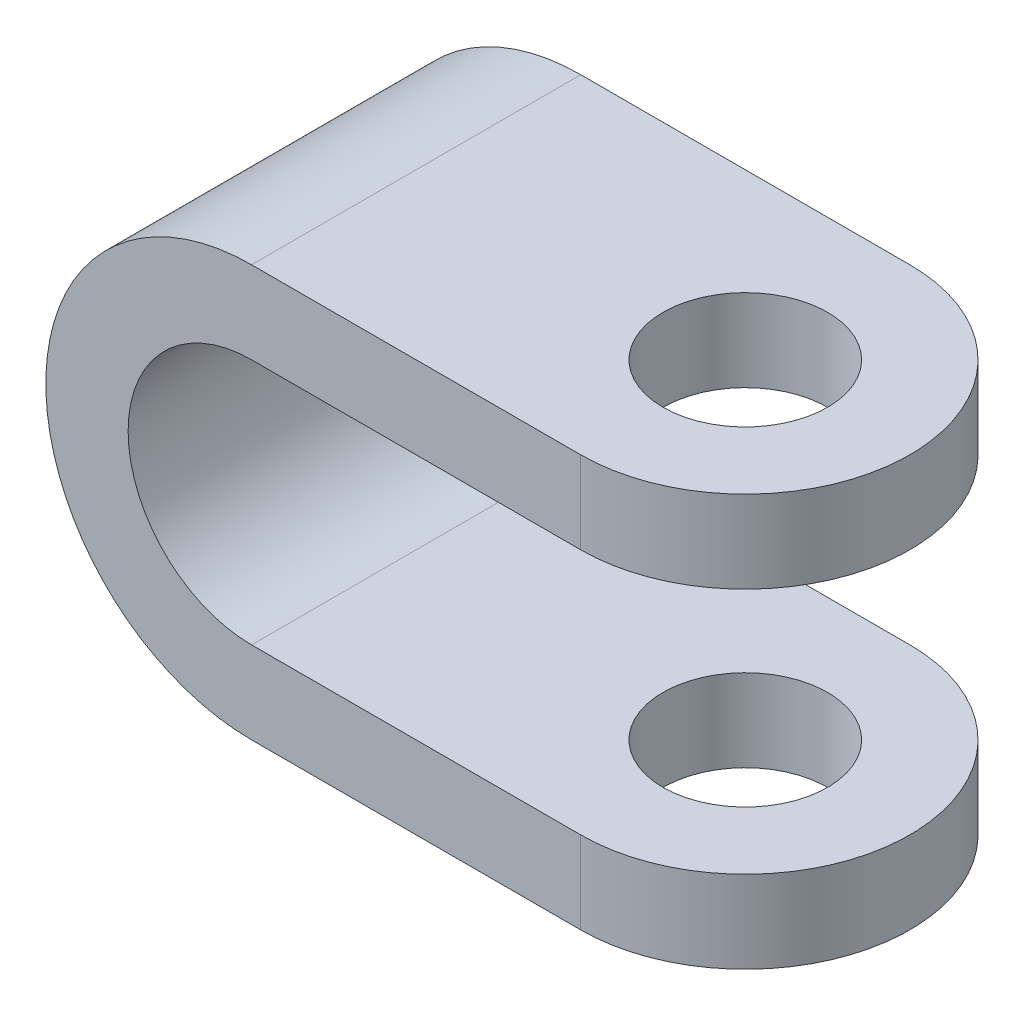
ISO-10303-21;
HEADER;
FILE_DESCRIPTION(('STEP AP214'),'2;1');
FILE_NAME('part.step','',(''),(''),'','','');
FILE_SCHEMA(('AUTOMOTIVE_DESIGN { 1 0 10303 214 1 1 1 1 }'));
ENDSEC;
DATA;
#1=APPLICATION_CONTEXT('core data for automotive mechanical design processes');
#2=APPLICATION_PROTOCOL_DEFINITION('international standard','automotive_design',2000,#1);
#3=PRODUCT_CONTEXT('',#1,'mechanical');
#4=PRODUCT('Part','Part','',(#3));
#5=PRODUCT_RELATED_PRODUCT_CATEGORY('part','',(#4));
#6=PRODUCT_DEFINITION_FORMATION('','',#4);
#7=PRODUCT_DEFINITION_CONTEXT('part definition',#1,'design');
#8=PRODUCT_DEFINITION('design','',#6,#7);
#9=PRODUCT_DEFINITION_SHAPE('','',#8);
#10=(LENGTH_UNIT() NAMED_UNIT(*) SI_UNIT(.MILLI.,.METRE.));
#11=(NAMED_UNIT(*) PLANE_ANGLE_UNIT() SI_UNIT($,.RADIAN.));
#12=(NAMED_UNIT(*) SI_UNIT($,.STERADIAN.) SOLID_ANGLE_UNIT());
#13=UNCERTAINTY_MEASURE_WITH_UNIT(LENGTH_MEASURE(1.E-05),#10,'distance_accuracy_value','');
#14=(GEOMETRIC_REPRESENTATION_CONTEXT(3) GLOBAL_UNCERTAINTY_ASSIGNED_CONTEXT((#13)) GLOBAL_UNIT_ASSIGNED_CONTEXT((#10,
#11,#12)) REPRESENTATION_CONTEXT('',''));
#15=CARTESIAN_POINT('',(0.,0.,0.));
#16=DIRECTION('',(0.,0.,1.));
#17=DIRECTION('',(1.,0.,0.));
#18=AXIS2_PLACEMENT_3D('',#15,#16,#17);
#19=CARTESIAN_POINT('',(-20.,-90.,45.));
#20=DIRECTION('',(0.,1.,0.));
#21=DIRECTION('',(0.,0.,1.));
#22=AXIS2_PLACEMENT_3D('',#19,#20,#21);
#23=CYLINDRICAL_SURFACE('',#22,10.);
#24=CARTESIAN_POINT('',(-20.,-25.,45.));
#25=DIRECTION('',(0.,-1.,0.));
#26=DIRECTION('',(1.,0.,0.));
#27=AXIS2_PLACEMENT_3D('',#24,#25,#26);
#28=CIRCLE('',#27,10.);
#29=CARTESIAN_POINT('',(-20.,-25.,55.));
#30=VERTEX_POINT('',#29);
#31=EDGE_CURVE('E169',#30,#30,#28,.F.);
#32=CARTESIAN_POINT('',(-20.,-15.,45.));
#33=DIRECTION('',(0.,-1.,0.));
#34=DIRECTION('',(1.,0.,0.));
#35=AXIS2_PLACEMENT_3D('',#32,#33,#34);
#36=CIRCLE('',#35,10.);
#37=CARTESIAN_POINT('',(-20.,-15.,55.));
#38=VERTEX_POINT('',#37);
#39=EDGE_CURVE('E112',#38,#38,#36,.F.);
#40=CARTESIAN_POINT('',(-20.,-25.,55.));
#41=CARTESIAN_POINT('',(-20.,-24.8958333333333,55.));
#42=CARTESIAN_POINT('',(-20.,-24.7916666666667,55.));
#43=CARTESIAN_POINT('',(-20.,-24.5833333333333,55.));
#44=CARTESIAN_POINT('',(-20.,-24.4791666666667,55.));
#45=CARTESIAN_POINT('',(-20.,-24.2708333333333,55.));
#46=CARTESIAN_POINT('',(-20.,-24.1666666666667,55.));
#47=CARTESIAN_POINT('',(-20.,-23.9583333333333,55.));
#48=CARTESIAN_POINT('',(-20.,-23.8541666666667,55.));
#49=CARTESIAN_POINT('',(-20.,-23.6458333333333,55.));
#50=CARTESIAN_POINT('',(-20.,-23.5416666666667,55.));
#51=CARTESIAN_POINT('',(-20.,-23.3333333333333,55.));
#52=CARTESIAN_POINT('',(-20.,-23.2291666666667,55.));
#53=CARTESIAN_POINT('',(-20.,-23.0208333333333,55.));
#54=CARTESIAN_POINT('',(-20.,-22.9166666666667,55.));
#55=CARTESIAN_POINT('',(-20.,-22.7083333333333,55.));
#56=CARTESIAN_POINT('',(-20.,-22.6041666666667,55.));
#57=CARTESIAN_POINT('',(-20.,-22.3958333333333,55.));
#58=CARTESIAN_POINT('',(-20.,-22.2916666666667,55.));
#59=CARTESIAN_POINT('',(-20.,-22.0833333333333,55.));
#60=CARTESIAN_POINT('',(-20.,-21.9791666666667,55.));
#61=CARTESIAN_POINT('',(-20.,-21.7708333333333,55.));
#62=CARTESIAN_POINT('',(-20.,-21.6666666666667,55.));
#63=CARTESIAN_POINT('',(-20.,-21.4583333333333,55.));
#64=CARTESIAN_POINT('',(-20.,-21.3541666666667,55.));
#65=CARTESIAN_POINT('',(-20.,-21.1458333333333,55.));
#66=CARTESIAN_POINT('',(-20.,-21.0416666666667,55.));
#67=CARTESIAN_POINT('',(-20.,-20.8333333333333,55.));
#68=CARTESIAN_POINT('',(-20.,-20.7291666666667,55.));
#69=CARTESIAN_POINT('',(-20.,-20.5208333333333,55.));
#70=CARTESIAN_POINT('',(-20.,-20.4166666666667,55.));
#71=CARTESIAN_POINT('',(-20.,-20.2083333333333,55.));
#72=CARTESIAN_POINT('',(-20.,-20.1041666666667,55.));
#73=CARTESIAN_POINT('',(-20.,-19.8958333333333,55.));
#74=CARTESIAN_POINT('',(-20.,-19.7916666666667,55.));
#75=CARTESIAN_POINT('',(-20.,-19.5833333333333,55.));
#76=CARTESIAN_POINT('',(-20.,-19.4791666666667,55.));
#77=CARTESIAN_POINT('',(-20.,-19.2708333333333,55.));
#78=CARTESIAN_POINT('',(-20.,-19.1666666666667,55.));
#79=CARTESIAN_POINT('',(-20.,-18.9583333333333,55.));
#80=CARTESIAN_POINT('',(-20.,-18.8541666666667,55.));
#81=CARTESIAN_POINT('',(-20.,-18.6458333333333,55.));
#82=CARTESIAN_POINT('',(-20.,-18.5416666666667,55.));
#83=CARTESIAN_POINT('',(-20.,-18.3333333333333,55.));
#84=CARTESIAN_POINT('',(-20.,-18.2291666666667,55.));
#85=CARTESIAN_POINT('',(-20.,-18.0208333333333,55.));
#86=CARTESIAN_POINT('',(-20.,-17.9166666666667,55.));
#87=CARTESIAN_POINT('',(-20.,-17.7083333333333,55.));
#88=CARTESIAN_POINT('',(-20.,-17.6041666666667,55.));
#89=CARTESIAN_POINT('',(-20.,-17.3958333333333,55.));
#90=CARTESIAN_POINT('',(-20.,-17.2916666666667,55.));
#91=CARTESIAN_POINT('',(-20.,-17.0833333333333,55.));
#92=CARTESIAN_POINT('',(-20.,-16.9791666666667,55.));
#93=CARTESIAN_POINT('',(-20.,-16.7708333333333,55.));
#94=CARTESIAN_POINT('',(-20.,-16.6666666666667,55.));
#95=CARTESIAN_POINT('',(-20.,-16.4583333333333,55.));
#96=CARTESIAN_POINT('',(-20.,-16.3541666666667,55.));
#97=CARTESIAN_POINT('',(-20.,-16.1458333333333,55.));
#98=CARTESIAN_POINT('',(-20.,-16.0416666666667,55.));
#99=CARTESIAN_POINT('',(-20.,-15.8333333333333,55.));
#100=CARTESIAN_POINT('',(-20.,-15.7291666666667,55.));
#101=CARTESIAN_POINT('',(-20.,-15.5208333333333,55.));
#102=CARTESIAN_POINT('',(-20.,-15.4166666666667,55.));
#103=CARTESIAN_POINT('',(-20.,-15.2083333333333,55.));
#104=CARTESIAN_POINT('',(-20.,-15.1041666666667,55.));
#105=CARTESIAN_POINT('',(-20.,-15.,55.));
#106=B_SPLINE_CURVE_WITH_KNOTS('',3,(#40,#41,#42,#43,#44,#45,#46,#47,#48,#49,#50,#51,#52,#53,
#54,#55,#56,#57,#58,#59,#60,#61,#62,#63,#64,#65,#66,#67,#68,#69,#70,#71,#72,#73,#74,#75,#76,#77,
#78,#79,#80,#81,#82,#83,#84,#85,#86,#87,#88,#89,#90,#91,#92,#93,#94,#95,#96,#97,#98,#99,#100,
#101,#102,#103,#104,#105),.UNSPECIFIED.,.F.,.F.,(4,2,2,2,2,2,2,2,2,2,2,2,2,2,2,2,2,2,2,2,2,2,2,
2,2,2,2,2,2,2,2,2,4),(0.,0.312499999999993,0.625000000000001,0.937500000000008,1.25,
1.56249999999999,1.875,2.18750000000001,2.5,2.8125,3.125,3.43750000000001,3.75,4.0625,4.375,
4.68750000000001,5.,5.3125,5.62500000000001,5.93750000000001,6.25000000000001,6.5625,
6.87500000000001,7.18750000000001,7.50000000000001,7.8125,8.12500000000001,8.43750000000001,
8.75000000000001,9.0625,9.37500000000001,9.68750000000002,10.),.UNSPECIFIED.);
#107=EDGE_CURVE('BSEAM34',#30,#38,#106,.T.);
#108=ORIENTED_EDGE('',*,*,#31,.F.);
#109=ORIENTED_EDGE('',*,*,#39,.T.);
#110=ORIENTED_EDGE('',*,*,#107,.T.);
#111=ORIENTED_EDGE('',*,*,#107,.F.);
#112=EDGE_LOOP('',(#108,#110,#109,#111));
#113=FACE_BOUND('',#112,.T.);
#114=ADVANCED_FACE('F34',(#113),#23,.F.);
#115=CARTESIAN_POINT('',(0.,-15.,90.));
#116=DIRECTION('',(0.,-1.,0.));
#117=DIRECTION('',(1.,0.,0.));
#118=AXIS2_PLACEMENT_3D('',#115,#116,#117);
#119=PLANE('',#118);
#120=CARTESIAN_POINT('',(-20.,-15.,45.));
#121=DIRECTION('',(0.,-1.,0.));
#122=DIRECTION('',(1.,0.,0.));
#123=AXIS2_PLACEMENT_3D('',#120,#121,#122);
#124=CIRCLE('',#123,20.);
#125=CARTESIAN_POINT('',(-20.,-15.0000000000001,65.));
#126=VERTEX_POINT('',#125);
#127=CARTESIAN_POINT('',(-20.,-15.,25.));
#128=VERTEX_POINT('',#127);
#129=EDGE_CURVE('E111',#126,#128,#124,.F.);
#130=ORIENTED_EDGE('',*,*,#129,.T.);
#131=DIRECTION('',(-1.,0.,0.));
#132=VECTOR('',#131,1.);
#133=CARTESIAN_POINT('',(-20.,-15.,25.));
#134=LINE('',#133,#132);
#135=CARTESIAN_POINT('',(-60.,-15.,25.));
#136=VERTEX_POINT('',#135);
#137=EDGE_CURVE('E122',#128,#136,#134,.T.);
#138=ORIENTED_EDGE('',*,*,#137,.T.);
#139=DIRECTION('',(0.,0.,-1.));
#140=VECTOR('',#139,1.);
#141=CARTESIAN_POINT('',(-60.,-15.,90.));
#142=LINE('',#141,#140);
#143=CARTESIAN_POINT('',(-60.,-15.,65.));
#144=VERTEX_POINT('',#143);
#145=EDGE_CURVE('E115',#144,#136,#142,.T.);
#146=ORIENTED_EDGE('',*,*,#145,.F.);
#147=DIRECTION('',(1.,0.,0.));
#148=VECTOR('',#147,1.);
#149=CARTESIAN_POINT('',(-85.,-15.,65.));
#150=LINE('',#149,#148);
#151=EDGE_CURVE('E98',#144,#126,#150,.T.);
#152=ORIENTED_EDGE('',*,*,#151,.T.);
#153=EDGE_LOOP('',(#130,#138,#146,#152));
#154=FACE_BOUND('',#153,.T.);
#155=ORIENTED_EDGE('',*,*,#39,.F.);
#156=EDGE_LOOP('',(#155));
#157=FACE_BOUND('',#156,.T.);
#158=ADVANCED_FACE('F120',(#154,#157),#119,.F.);
#159=CARTESIAN_POINT('',(-60.,-40.,90.));
#160=DIRECTION('',(0.,0.,-1.));
#161=DIRECTION('',(-1.,0.,0.));
#162=AXIS2_PLACEMENT_3D('',#159,#160,#161);
#163=CYLINDRICAL_SURFACE('',#162,25.);
#164=ORIENTED_EDGE('',*,*,#145,.T.);
#165=CARTESIAN_POINT('',(-60.,-40.,25.));
#166=DIRECTION('',(0.,0.,-1.));
#167=DIRECTION('',(-1.,0.,0.));
#168=AXIS2_PLACEMENT_3D('',#165,#166,#167);
#169=CIRCLE('',#168,25.);
#170=CARTESIAN_POINT('',(-60.,-65.,25.));
#171=VERTEX_POINT('',#170);
#172=EDGE_CURVE('E49',#136,#171,#169,.F.);
#173=ORIENTED_EDGE('',*,*,#172,.T.);
#174=DIRECTION('',(0.,0.,-1.));
#175=VECTOR('',#174,1.);
#176=CARTESIAN_POINT('',(-60.,-65.,90.));
#177=LINE('',#176,#175);
#178=CARTESIAN_POINT('',(-60.,-65.,65.));
#179=VERTEX_POINT('',#178);
#180=EDGE_CURVE('E117',#179,#171,#177,.T.);
#181=ORIENTED_EDGE('',*,*,#180,.F.);
#182=CARTESIAN_POINT('',(-60.,-40.,65.));
#183=DIRECTION('',(0.,0.,1.));
#184=DIRECTION('',(1.,0.,0.));
#185=AXIS2_PLACEMENT_3D('',#182,#183,#184);
#186=CIRCLE('',#185,25.);
#187=EDGE_CURVE('E103',#179,#144,#186,.F.);
#188=ORIENTED_EDGE('',*,*,#187,.T.);
#189=EDGE_LOOP('',(#164,#173,#181,#188));
#190=FACE_BOUND('',#189,.T.);
#191=ADVANCED_FACE('F114',(#190),#163,.T.);
#192=CARTESIAN_POINT('',(-60.,-65.,90.));
#193=DIRECTION('',(0.,1.,0.));
#194=DIRECTION('',(-1.,0.,0.));
#195=AXIS2_PLACEMENT_3D('',#192,#193,#194);
#196=PLANE('',#195);
#197=ORIENTED_EDGE('',*,*,#180,.T.);
#198=DIRECTION('',(1.,0.,0.));
#199=VECTOR('',#198,1.);
#200=CARTESIAN_POINT('',(-20.,-65.,25.));
#201=LINE('',#200,#199);
#202=CARTESIAN_POINT('',(-20.,-65.,25.));
#203=VERTEX_POINT('',#202);
#204=EDGE_CURVE('E118',#171,#203,#201,.T.);
#205=ORIENTED_EDGE('',*,*,#204,.T.);
#206=CARTESIAN_POINT('',(-20.,-65.,45.));
#207=DIRECTION('',(0.,1.,0.));
#208=DIRECTION('',(-1.,0.,0.));
#209=AXIS2_PLACEMENT_3D('',#206,#207,#208);
#210=CIRCLE('',#209,20.);
#211=CARTESIAN_POINT('',(-20.,-65.,65.));
#212=VERTEX_POINT('',#211);
#213=EDGE_CURVE('E153',#203,#212,#210,.F.);
#214=ORIENTED_EDGE('',*,*,#213,.T.);
#215=DIRECTION('',(-1.,0.,0.));
#216=VECTOR('',#215,1.);
#217=CARTESIAN_POINT('',(-85.,-65.,65.));
#218=LINE('',#217,#216);
#219=EDGE_CURVE('E151',#212,#179,#218,.T.);
#220=ORIENTED_EDGE('',*,*,#219,.T.);
#221=EDGE_LOOP('',(#197,#205,#214,#220));
#222=FACE_BOUND('',#221,.T.);
#223=CARTESIAN_POINT('',(-20.,-65.,45.));
#224=DIRECTION('',(0.,1.,0.));
#225=DIRECTION('',(-1.,0.,0.));
#226=AXIS2_PLACEMENT_3D('',#223,#224,#225);
#227=CIRCLE('',#226,10.);
#228=CARTESIAN_POINT('',(-20.,-65.,55.));
#229=VERTEX_POINT('',#228);
#230=EDGE_CURVE('E150',#229,#229,#227,.F.);
#231=ORIENTED_EDGE('',*,*,#230,.F.);
#232=EDGE_LOOP('',(#231));
#233=FACE_BOUND('',#232,.T.);
#234=ADVANCED_FACE('F178',(#222,#233),#196,.F.);
#235=CARTESIAN_POINT('',(-60.,-55.,90.));
#236=DIRECTION('',(0.,1.,0.));
#237=DIRECTION('',(-1.,0.,0.));
#238=AXIS2_PLACEMENT_3D('',#235,#236,#237);
#239=PLANE('',#238);
#240=DIRECTION('',(1.,0.,0.));
#241=VECTOR('',#240,1.);
#242=CARTESIAN_POINT('',(-20.,-55.,25.));
#243=LINE('',#242,#241);
#244=CARTESIAN_POINT('',(-60.,-55.,25.0000000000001));
#245=VERTEX_POINT('',#244);
#246=CARTESIAN_POINT('',(-20.,-55.,25.));
#247=VERTEX_POINT('',#246);
#248=EDGE_CURVE('E147',#245,#247,#243,.T.);
#249=ORIENTED_EDGE('',*,*,#248,.F.);
#250=DIRECTION('',(0.,0.,-1.));
#251=VECTOR('',#250,1.);
#252=CARTESIAN_POINT('',(-60.,-55.,90.));
#253=LINE('',#252,#251);
#254=CARTESIAN_POINT('',(-60.,-55.,65.));
#255=VERTEX_POINT('',#254);
#256=EDGE_CURVE('E126',#255,#245,#253,.T.);
#257=ORIENTED_EDGE('',*,*,#256,.F.);
#258=DIRECTION('',(-1.,0.,0.));
#259=VECTOR('',#258,1.);
#260=CARTESIAN_POINT('',(-85.,-55.,65.));
#261=LINE('',#260,#259);
#262=CARTESIAN_POINT('',(-20.,-55.,65.));
#263=VERTEX_POINT('',#262);
#264=EDGE_CURVE('E142',#263,#255,#261,.T.);
#265=ORIENTED_EDGE('',*,*,#264,.F.);
#266=CARTESIAN_POINT('',(-20.,-55.,45.));
#267=DIRECTION('',(0.,1.,0.));
#268=DIRECTION('',(-1.,0.,0.));
#269=AXIS2_PLACEMENT_3D('',#266,#267,#268);
#270=CIRCLE('',#269,20.);
#271=EDGE_CURVE('E145',#247,#263,#270,.F.);
#272=ORIENTED_EDGE('',*,*,#271,.F.);
#273=EDGE_LOOP('',(#249,#257,#265,#272));
#274=FACE_BOUND('',#273,.T.);
#275=CARTESIAN_POINT('',(-20.,-55.,45.));
#276=DIRECTION('',(0.,1.,0.));
#277=DIRECTION('',(-1.,0.,0.));
#278=AXIS2_PLACEMENT_3D('',#275,#276,#277);
#279=CIRCLE('',#278,10.);
#280=CARTESIAN_POINT('',(-20.,-55.,55.));
#281=VERTEX_POINT('',#280);
#282=EDGE_CURVE('E42',#281,#281,#279,.F.);
#283=ORIENTED_EDGE('',*,*,#282,.T.);
#284=EDGE_LOOP('',(#283));
#285=FACE_BOUND('',#284,.T.);
#286=ADVANCED_FACE('F180',(#274,#285),#239,.T.);
#287=CARTESIAN_POINT('',(0.,-25.,90.));
#288=DIRECTION('',(0.,-1.,0.));
#289=DIRECTION('',(1.,0.,0.));
#290=AXIS2_PLACEMENT_3D('',#287,#288,#289);
#291=PLANE('',#290);
#292=DIRECTION('',(-1.,0.,0.));
#293=VECTOR('',#292,1.);
#294=CARTESIAN_POINT('',(-20.,-25.,25.));
#295=LINE('',#294,#293);
#296=CARTESIAN_POINT('',(-20.,-25.,25.));
#297=VERTEX_POINT('',#296);
#298=CARTESIAN_POINT('',(-60.,-25.,25.));
#299=VERTEX_POINT('',#298);
#300=EDGE_CURVE('E139',#297,#299,#295,.T.);
#301=ORIENTED_EDGE('',*,*,#300,.F.);
#302=CARTESIAN_POINT('',(-20.,-25.,45.));
#303=DIRECTION('',(0.,-1.,0.));
#304=DIRECTION('',(1.,0.,0.));
#305=AXIS2_PLACEMENT_3D('',#302,#303,#304);
#306=CIRCLE('',#305,20.);
#307=CARTESIAN_POINT('',(-20.,-25.,65.));
#308=VERTEX_POINT('',#307);
#309=EDGE_CURVE('E136',#308,#297,#306,.F.);
#310=ORIENTED_EDGE('',*,*,#309,.F.);
#311=DIRECTION('',(1.,0.,0.));
#312=VECTOR('',#311,1.);
#313=CARTESIAN_POINT('',(-85.,-25.,65.));
#314=LINE('',#313,#312);
#315=CARTESIAN_POINT('',(-60.,-25.,65.));
#316=VERTEX_POINT('',#315);
#317=EDGE_CURVE('E134',#316,#308,#314,.T.);
#318=ORIENTED_EDGE('',*,*,#317,.F.);
#319=DIRECTION('',(0.,0.,-1.));
#320=VECTOR('',#319,1.);
#321=CARTESIAN_POINT('',(-60.,-25.,90.));
#322=LINE('',#321,#320);
#323=EDGE_CURVE('E123',#316,#299,#322,.T.);
#324=ORIENTED_EDGE('',*,*,#323,.T.);
#325=EDGE_LOOP('',(#301,#310,#318,#324));
#326=FACE_BOUND('',#325,.T.);
#327=ORIENTED_EDGE('',*,*,#31,.T.);
#328=EDGE_LOOP('',(#327));
#329=FACE_BOUND('',#328,.T.);
#330=ADVANCED_FACE('F187',(#326,#329),#291,.T.);
#331=CARTESIAN_POINT('',(-60.,-40.,90.));
#332=DIRECTION('',(0.,0.,-1.));
#333=DIRECTION('',(-1.,0.,0.));
#334=AXIS2_PLACEMENT_3D('',#331,#332,#333);
#335=CYLINDRICAL_SURFACE('',#334,15.);
#336=CARTESIAN_POINT('',(-60.,-40.,25.));
#337=DIRECTION('',(0.,0.,-1.));
#338=DIRECTION('',(-1.,0.,0.));
#339=AXIS2_PLACEMENT_3D('',#336,#337,#338);
#340=CIRCLE('',#339,15.);
#341=EDGE_CURVE('E158',#299,#245,#340,.F.);
#342=ORIENTED_EDGE('',*,*,#341,.F.);
#343=ORIENTED_EDGE('',*,*,#323,.F.);
#344=CARTESIAN_POINT('',(-60.,-40.,65.));
#345=DIRECTION('',(0.,0.,1.));
#346=DIRECTION('',(1.,0.,0.));
#347=AXIS2_PLACEMENT_3D('',#344,#345,#346);
#348=CIRCLE('',#347,15.);
#349=EDGE_CURVE('E11',#255,#316,#348,.F.);
#350=ORIENTED_EDGE('',*,*,#349,.F.);
#351=ORIENTED_EDGE('',*,*,#256,.T.);
#352=EDGE_LOOP('',(#342,#343,#350,#351));
#353=FACE_BOUND('',#352,.T.);
#354=ADVANCED_FACE('F202',(#353),#335,.F.);
#355=CARTESIAN_POINT('',(-20.,-55.,55.));
#356=CARTESIAN_POINT('',(-20.,-55.1041666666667,55.));
#357=CARTESIAN_POINT('',(-20.,-55.2083333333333,55.));
#358=CARTESIAN_POINT('',(-20.,-55.4166666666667,55.));
#359=CARTESIAN_POINT('',(-20.,-55.5208333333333,55.));
#360=CARTESIAN_POINT('',(-20.,-55.7291666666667,55.));
#361=CARTESIAN_POINT('',(-20.,-55.8333333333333,55.));
#362=CARTESIAN_POINT('',(-20.,-56.0416666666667,55.));
#363=CARTESIAN_POINT('',(-20.,-56.1458333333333,55.));
#364=CARTESIAN_POINT('',(-20.,-56.3541666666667,55.));
#365=CARTESIAN_POINT('',(-20.,-56.4583333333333,55.));
#366=CARTESIAN_POINT('',(-20.,-56.6666666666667,55.));
#367=CARTESIAN_POINT('',(-20.,-56.7708333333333,55.));
#368=CARTESIAN_POINT('',(-20.,-56.9791666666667,55.));
#369=CARTESIAN_POINT('',(-20.,-57.0833333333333,55.));
#370=CARTESIAN_POINT('',(-20.,-57.2916666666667,55.));
#371=CARTESIAN_POINT('',(-20.,-57.3958333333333,55.));
#372=CARTESIAN_POINT('',(-20.,-57.6041666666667,55.));
#373=CARTESIAN_POINT('',(-20.,-57.7083333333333,55.));
#374=CARTESIAN_POINT('',(-20.,-57.9166666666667,55.));
#375=CARTESIAN_POINT('',(-20.,-58.0208333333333,55.));
#376=CARTESIAN_POINT('',(-20.,-58.2291666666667,55.));
#377=CARTESIAN_POINT('',(-20.,-58.3333333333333,55.));
#378=CARTESIAN_POINT('',(-20.,-58.5416666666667,55.));
#379=CARTESIAN_POINT('',(-20.,-58.6458333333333,55.));
#380=CARTESIAN_POINT('',(-20.,-58.8541666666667,55.));
#381=CARTESIAN_POINT('',(-20.,-58.9583333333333,55.));
#382=CARTESIAN_POINT('',(-20.,-59.1666666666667,55.));
#383=CARTESIAN_POINT('',(-20.,-59.2708333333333,55.));
#384=CARTESIAN_POINT('',(-20.,-59.4791666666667,55.));
#385=CARTESIAN_POINT('',(-20.,-59.5833333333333,55.));
#386=CARTESIAN_POINT('',(-20.,-59.7916666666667,55.));
#387=CARTESIAN_POINT('',(-20.,-59.8958333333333,55.));
#388=CARTESIAN_POINT('',(-20.,-60.1041666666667,55.));
#389=CARTESIAN_POINT('',(-20.,-60.2083333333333,55.));
#390=CARTESIAN_POINT('',(-20.,-60.4166666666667,55.));
#391=CARTESIAN_POINT('',(-20.,-60.5208333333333,55.));
#392=CARTESIAN_POINT('',(-20.,-60.7291666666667,55.));
#393=CARTESIAN_POINT('',(-20.,-60.8333333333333,55.));
#394=CARTESIAN_POINT('',(-20.,-61.0416666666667,55.));
#395=CARTESIAN_POINT('',(-20.,-61.1458333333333,55.));
#396=CARTESIAN_POINT('',(-20.,-61.3541666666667,55.));
#397=CARTESIAN_POINT('',(-20.,-61.4583333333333,55.));
#398=CARTESIAN_POINT('',(-20.,-61.6666666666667,55.));
#399=CARTESIAN_POINT('',(-20.,-61.7708333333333,55.));
#400=CARTESIAN_POINT('',(-20.,-61.9791666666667,55.));
#401=CARTESIAN_POINT('',(-20.,-62.0833333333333,55.));
#402=CARTESIAN_POINT('',(-20.,-62.2916666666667,55.));
#403=CARTESIAN_POINT('',(-20.,-62.3958333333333,55.));
#404=CARTESIAN_POINT('',(-20.,-62.6041666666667,55.));
#405=CARTESIAN_POINT('',(-20.,-62.7083333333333,55.));
#406=CARTESIAN_POINT('',(-20.,-62.9166666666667,55.));
#407=CARTESIAN_POINT('',(-20.,-63.0208333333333,55.));
#408=CARTESIAN_POINT('',(-20.,-63.2291666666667,55.));
#409=CARTESIAN_POINT('',(-20.,-63.3333333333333,55.));
#410=CARTESIAN_POINT('',(-20.,-63.5416666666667,55.));
#411=CARTESIAN_POINT('',(-20.,-63.6458333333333,55.));
#412=CARTESIAN_POINT('',(-20.,-63.8541666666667,55.));
#413=CARTESIAN_POINT('',(-20.,-63.9583333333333,55.));
#414=CARTESIAN_POINT('',(-20.,-64.1666666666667,55.));
#415=CARTESIAN_POINT('',(-20.,-64.2708333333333,55.));
#416=CARTESIAN_POINT('',(-20.,-64.4791666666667,55.));
#417=CARTESIAN_POINT('',(-20.,-64.5833333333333,55.));
#418=CARTESIAN_POINT('',(-20.,-64.7916666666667,55.));
#419=CARTESIAN_POINT('',(-20.,-64.8958333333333,55.));
#420=CARTESIAN_POINT('',(-20.,-65.,55.));
#421=B_SPLINE_CURVE_WITH_KNOTS('',3,(#355,#356,#357,#358,#359,#360,#361,#362,#363,#364,#365,
#366,#367,#368,#369,#370,#371,#372,#373,#374,#375,#376,#377,#378,#379,#380,#381,#382,#383,#384,
#385,#386,#387,#388,#389,#390,#391,#392,#393,#394,#395,#396,#397,#398,#399,#400,#401,#402,#403,
#404,#405,#406,#407,#408,#409,#410,#411,#412,#413,#414,#415,#416,#417,#418,#419,#420),
.UNSPECIFIED.,.F.,.F.,(4,2,2,2,2,2,2,2,2,2,2,2,2,2,2,2,2,2,2,2,2,2,2,2,2,2,2,2,2,2,2,2,4),(0.,
0.3125,0.625000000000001,0.937500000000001,1.25,1.5625,1.875,2.1875,2.5,2.8125,3.125,3.4375,
3.75,4.0625,4.375,4.6875,5.,5.3125,5.625,5.9375,6.25,6.5625,6.875,7.18749999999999,7.5,
7.81249999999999,8.125,8.43749999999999,8.75,9.06249999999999,9.375,9.68749999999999,10.),.UNSPECIFIED.);
#422=EDGE_CURVE('BSEAM176',#281,#229,#421,.T.);
#423=ORIENTED_EDGE('',*,*,#282,.F.);
#424=ORIENTED_EDGE('',*,*,#230,.T.);
#425=ORIENTED_EDGE('',*,*,#422,.T.);
#426=ORIENTED_EDGE('',*,*,#422,.F.);
#427=EDGE_LOOP('',(#423,#425,#424,#426));
#428=FACE_BOUND('',#427,.T.);
#429=ADVANCED_FACE('F176',(#428),#23,.F.);
#430=CARTESIAN_POINT('',(-20.,-90.,25.));
#431=DIRECTION('',(0.,0.,-1.));
#432=DIRECTION('',(-1.,0.,0.));
#433=AXIS2_PLACEMENT_3D('',#430,#431,#432);
#434=PLANE('',#433);
#435=ORIENTED_EDGE('',*,*,#341,.T.);
#436=ORIENTED_EDGE('',*,*,#248,.T.);
#437=DIRECTION('',(0.,1.,0.));
#438=VECTOR('',#437,1.);
#439=CARTESIAN_POINT('',(-20.,-90.,25.));
#440=LINE('',#439,#438);
#441=EDGE_CURVE('E164',#203,#247,#440,.T.);
#442=ORIENTED_EDGE('',*,*,#441,.F.);
#443=ORIENTED_EDGE('',*,*,#204,.F.);
#444=ORIENTED_EDGE('',*,*,#172,.F.);
#445=ORIENTED_EDGE('',*,*,#137,.F.);
#446=EDGE_CURVE('E161',#297,#128,#440,.T.);
#447=ORIENTED_EDGE('',*,*,#446,.F.);
#448=ORIENTED_EDGE('',*,*,#300,.T.);
#449=EDGE_LOOP('',(#435,#436,#442,#443,#444,#445,#447,#448));
#450=FACE_BOUND('',#449,.T.);
#451=ADVANCED_FACE('F36',(#450),#434,.T.);
#452=CARTESIAN_POINT('',(-20.,-90.,45.));
#453=DIRECTION('',(0.,1.,0.));
#454=DIRECTION('',(0.,0.,1.));
#455=AXIS2_PLACEMENT_3D('',#452,#453,#454);
#456=CYLINDRICAL_SURFACE('',#455,20.);
#457=ORIENTED_EDGE('',*,*,#213,.F.);
#458=ORIENTED_EDGE('',*,*,#441,.T.);
#459=ORIENTED_EDGE('',*,*,#271,.T.);
#460=DIRECTION('',(0.,1.,0.));
#461=VECTOR('',#460,1.);
#462=CARTESIAN_POINT('',(-20.,-90.,65.));
#463=LINE('',#462,#461);
#464=EDGE_CURVE('E165',#212,#263,#463,.T.);
#465=ORIENTED_EDGE('',*,*,#464,.F.);
#466=EDGE_LOOP('',(#457,#458,#459,#465));
#467=FACE_BOUND('',#466,.T.);
#468=ADVANCED_FACE('F208',(#467),#456,.T.);
#469=EDGE_CURVE('E107',#308,#126,#463,.T.);
#470=ORIENTED_EDGE('',*,*,#469,.F.);
#471=ORIENTED_EDGE('',*,*,#309,.T.);
#472=ORIENTED_EDGE('',*,*,#446,.T.);
#473=ORIENTED_EDGE('',*,*,#129,.F.);
#474=EDGE_LOOP('',(#470,#471,#472,#473));
#475=FACE_BOUND('',#474,.T.);
#476=ADVANCED_FACE('F223',(#475),#456,.T.);
#477=CARTESIAN_POINT('',(-85.,-90.,65.));
#478=DIRECTION('',(0.,0.,1.));
#479=DIRECTION('',(1.,0.,0.));
#480=AXIS2_PLACEMENT_3D('',#477,#478,#479);
#481=PLANE('',#480);
#482=ORIENTED_EDGE('',*,*,#464,.T.);
#483=ORIENTED_EDGE('',*,*,#264,.T.);
#484=ORIENTED_EDGE('',*,*,#349,.T.);
#485=ORIENTED_EDGE('',*,*,#317,.T.);
#486=ORIENTED_EDGE('',*,*,#469,.T.);
#487=ORIENTED_EDGE('',*,*,#151,.F.);
#488=ORIENTED_EDGE('',*,*,#187,.F.);
#489=ORIENTED_EDGE('',*,*,#219,.F.);
#490=EDGE_LOOP('',(#482,#483,#484,#485,#486,#487,#488,#489));
#491=FACE_BOUND('',#490,.T.);
#492=ADVANCED_FACE('F101',(#491),#481,.T.);
#493=CLOSED_SHELL('',(#114,#158,#191,#234,#286,#330,#354,#429,#451,#468,#476,#492));
#494=MANIFOLD_SOLID_BREP('B2',#493);
#495=ADVANCED_BREP_SHAPE_REPRESENTATION('',(#18,#494),#14);
#496=SHAPE_DEFINITION_REPRESENTATION(#9,#495);
ENDSEC;
END-ISO-10303-21;
